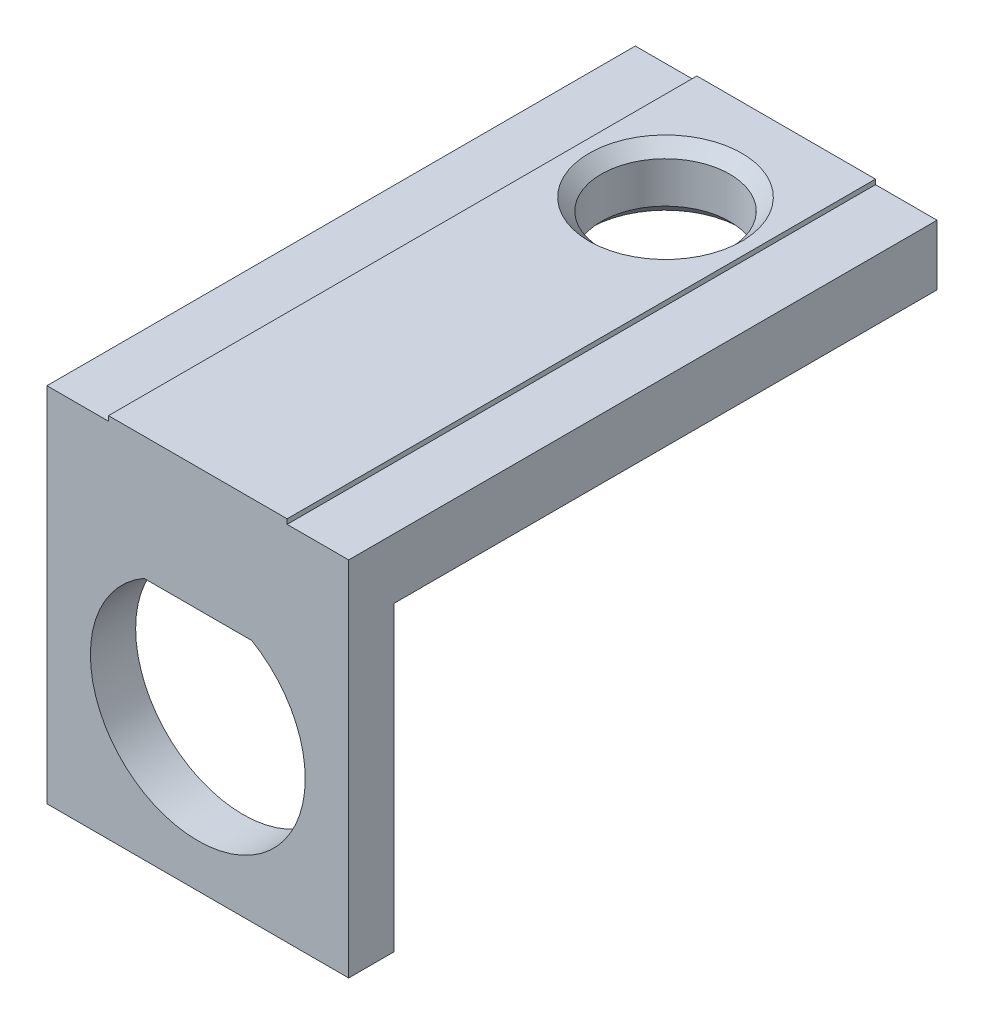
ISO-10303-21;
HEADER;
FILE_DESCRIPTION(('STEP AP214'),'2;1');
FILE_NAME('part.step','',(''),(''),'','','');
FILE_SCHEMA(('AUTOMOTIVE_DESIGN { 1 0 10303 214 1 1 1 1 }'));
ENDSEC;
DATA;
#1=APPLICATION_CONTEXT('core data for automotive mechanical design processes');
#2=APPLICATION_PROTOCOL_DEFINITION('international standard','automotive_design',2000,#1);
#3=PRODUCT_CONTEXT('',#1,'mechanical');
#4=PRODUCT('Part','Part','',(#3));
#5=PRODUCT_RELATED_PRODUCT_CATEGORY('part','',(#4));
#6=PRODUCT_DEFINITION_FORMATION('','',#4);
#7=PRODUCT_DEFINITION_CONTEXT('part definition',#1,'design');
#8=PRODUCT_DEFINITION('design','',#6,#7);
#9=PRODUCT_DEFINITION_SHAPE('','',#8);
#10=(LENGTH_UNIT() NAMED_UNIT(*) SI_UNIT(.MILLI.,.METRE.));
#11=(NAMED_UNIT(*) PLANE_ANGLE_UNIT() SI_UNIT($,.RADIAN.));
#12=(NAMED_UNIT(*) SI_UNIT($,.STERADIAN.) SOLID_ANGLE_UNIT());
#13=UNCERTAINTY_MEASURE_WITH_UNIT(LENGTH_MEASURE(1.E-05),#10,'distance_accuracy_value','');
#14=(GEOMETRIC_REPRESENTATION_CONTEXT(3) GLOBAL_UNCERTAINTY_ASSIGNED_CONTEXT((#13)) GLOBAL_UNIT_ASSIGNED_CONTEXT((#10,
#11,#12)) REPRESENTATION_CONTEXT('',''));
#15=CARTESIAN_POINT('',(0.,0.,0.));
#16=DIRECTION('',(0.,0.,1.));
#17=DIRECTION('',(1.,0.,0.));
#18=AXIS2_PLACEMENT_3D('',#15,#16,#17);
#19=CARTESIAN_POINT('',(-7.9375,11.1125,2.38125));
#20=DIRECTION('',(0.,-1.,0.));
#21=DIRECTION('',(0.,0.,-1.));
#22=AXIS2_PLACEMENT_3D('',#19,#20,#21);
#23=PLANE('',#22);
#24=DIRECTION('',(0.,0.,1.));
#25=VECTOR('',#24,1.);
#26=CARTESIAN_POINT('',(-4.699,11.1125,-28.575));
#27=LINE('',#26,#25);
#28=CARTESIAN_POINT('',(-4.699,11.1125,-28.575));
#29=VERTEX_POINT('',#28);
#30=CARTESIAN_POINT('',(-4.699,11.1125,2.38125));
#31=VERTEX_POINT('',#30);
#32=EDGE_CURVE('E151',#29,#31,#27,.T.);
#33=ORIENTED_EDGE('',*,*,#32,.F.);
#34=DIRECTION('',(1.,0.,0.));
#35=VECTOR('',#34,1.);
#36=CARTESIAN_POINT('',(7.9375,11.1125,-28.575));
#37=LINE('',#36,#35);
#38=CARTESIAN_POINT('',(-7.9375,11.1125,-28.575));
#39=VERTEX_POINT('',#38);
#40=EDGE_CURVE('E393',#39,#29,#37,.T.);
#41=ORIENTED_EDGE('',*,*,#40,.F.);
#42=DIRECTION('',(0.,0.,-1.));
#43=VECTOR('',#42,1.);
#44=CARTESIAN_POINT('',(-7.9375,11.1125,2.38125));
#45=LINE('',#44,#43);
#46=CARTESIAN_POINT('',(-7.9375,11.1125,2.38125));
#47=VERTEX_POINT('',#46);
#48=EDGE_CURVE('E45',#47,#39,#45,.T.);
#49=ORIENTED_EDGE('',*,*,#48,.F.);
#50=DIRECTION('',(-1.,0.,0.));
#51=VECTOR('',#50,1.);
#52=CARTESIAN_POINT('',(-7.9375,11.1125,2.38125));
#53=LINE('',#52,#51);
#54=EDGE_CURVE('E53',#31,#47,#53,.T.);
#55=ORIENTED_EDGE('',*,*,#54,.F.);
#56=EDGE_LOOP('',(#33,#41,#49,#55));
#57=FACE_BOUND('',#56,.T.);
#58=ADVANCED_FACE('F36',(#57),#23,.F.);
#59=DIRECTION('',(0.,0.,-1.));
#60=VECTOR('',#59,1.);
#61=CARTESIAN_POINT('',(4.699,11.1125,-28.575));
#62=LINE('',#61,#60);
#63=CARTESIAN_POINT('',(4.699,11.1125,2.38125));
#64=VERTEX_POINT('',#63);
#65=CARTESIAN_POINT('',(4.699,11.1125,-28.575));
#66=VERTEX_POINT('',#65);
#67=EDGE_CURVE('E61',#64,#66,#62,.T.);
#68=ORIENTED_EDGE('',*,*,#67,.F.);
#69=CARTESIAN_POINT('',(7.9375,11.1125,2.38125));
#70=VERTEX_POINT('',#69);
#71=EDGE_CURVE('E377',#70,#64,#53,.T.);
#72=ORIENTED_EDGE('',*,*,#71,.F.);
#73=DIRECTION('',(0.,0.,-1.));
#74=VECTOR('',#73,1.);
#75=CARTESIAN_POINT('',(7.9375,11.1125,2.38125));
#76=LINE('',#75,#74);
#77=CARTESIAN_POINT('',(7.9375,11.1125,-28.575));
#78=VERTEX_POINT('',#77);
#79=EDGE_CURVE('E11',#70,#78,#76,.T.);
#80=ORIENTED_EDGE('',*,*,#79,.T.);
#81=EDGE_CURVE('E390',#66,#78,#37,.T.);
#82=ORIENTED_EDGE('',*,*,#81,.F.);
#83=EDGE_LOOP('',(#68,#72,#80,#82));
#84=FACE_BOUND('',#83,.T.);
#85=ADVANCED_FACE('F225',(#84),#23,.F.);
#86=CARTESIAN_POINT('',(7.93750000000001,-11.1125,0.));
#87=DIRECTION('',(0.,0.,1.));
#88=DIRECTION('',(1.,0.,0.));
#89=AXIS2_PLACEMENT_3D('',#86,#87,#88);
#90=PLANE('',#89);
#91=CARTESIAN_POINT('',(0.,0.,0.));
#92=DIRECTION('',(0.,0.,1.));
#93=DIRECTION('',(1.,0.,0.));
#94=AXIS2_PLACEMENT_3D('',#91,#92,#93);
#95=CIRCLE('',#94,5.65150000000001);
#96=CARTESIAN_POINT('',(-2.83412102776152,4.8895,0.));
#97=VERTEX_POINT('',#96);
#98=CARTESIAN_POINT('',(2.83412102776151,4.8895,0.));
#99=VERTEX_POINT('',#98);
#100=EDGE_CURVE('E419',#97,#99,#95,.T.);
#101=ORIENTED_EDGE('',*,*,#100,.T.);
#102=DIRECTION('',(-1.,0.,0.));
#103=VECTOR('',#102,1.);
#104=CARTESIAN_POINT('',(-2.83412102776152,4.8895,0.));
#105=LINE('',#104,#103);
#106=EDGE_CURVE('E451',#99,#97,#105,.T.);
#107=ORIENTED_EDGE('',*,*,#106,.T.);
#108=EDGE_LOOP('',(#101,#107));
#109=FACE_BOUND('',#108,.T.);
#110=DIRECTION('',(0.,1.,0.));
#111=VECTOR('',#110,1.);
#112=CARTESIAN_POINT('',(7.9375,11.1125,0.));
#113=LINE('',#112,#111);
#114=CARTESIAN_POINT('',(7.93750000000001,-7.93750000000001,0.));
#115=VERTEX_POINT('',#114);
#116=CARTESIAN_POINT('',(7.9375,7.93749999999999,0.));
#117=VERTEX_POINT('',#116);
#118=EDGE_CURVE('E379',#115,#117,#113,.T.);
#119=ORIENTED_EDGE('',*,*,#118,.F.);
#120=DIRECTION('',(1.,0.,0.));
#121=VECTOR('',#120,1.);
#122=CARTESIAN_POINT('',(7.93750000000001,-7.93750000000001,0.));
#123=LINE('',#122,#121);
#124=CARTESIAN_POINT('',(-7.9375,-7.93750000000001,0.));
#125=VERTEX_POINT('',#124);
#126=EDGE_CURVE('E152',#125,#115,#123,.T.);
#127=ORIENTED_EDGE('',*,*,#126,.F.);
#128=DIRECTION('',(0.,-1.,0.));
#129=VECTOR('',#128,1.);
#130=CARTESIAN_POINT('',(-7.9375,11.1125,0.));
#131=LINE('',#130,#129);
#132=CARTESIAN_POINT('',(-7.9375,7.93749999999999,0.));
#133=VERTEX_POINT('',#132);
#134=EDGE_CURVE('E375',#133,#125,#131,.T.);
#135=ORIENTED_EDGE('',*,*,#134,.F.);
#136=DIRECTION('',(-1.,0.,0.));
#137=VECTOR('',#136,1.);
#138=CARTESIAN_POINT('',(7.9375,7.93749999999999,0.));
#139=LINE('',#138,#137);
#140=EDGE_CURVE('E406',#117,#133,#139,.T.);
#141=ORIENTED_EDGE('',*,*,#140,.F.);
#142=EDGE_LOOP('',(#119,#127,#135,#141));
#143=FACE_BOUND('',#142,.T.);
#144=ADVANCED_FACE('F229',(#109,#143),#90,.F.);
#145=CARTESIAN_POINT('',(7.93750000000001,-11.1125,2.38125));
#146=DIRECTION('',(0.,0.,1.));
#147=DIRECTION('',(1.,0.,0.));
#148=AXIS2_PLACEMENT_3D('',#145,#146,#147);
#149=PLANE('',#148);
#150=DIRECTION('',(1.,0.,0.));
#151=VECTOR('',#150,1.);
#152=CARTESIAN_POINT('',(7.93750000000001,-7.93750000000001,2.38125));
#153=LINE('',#152,#151);
#154=CARTESIAN_POINT('',(-7.9375,-7.93750000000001,2.38125));
#155=VERTEX_POINT('',#154);
#156=CARTESIAN_POINT('',(7.93750000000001,-7.93750000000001,2.38125));
#157=VERTEX_POINT('',#156);
#158=EDGE_CURVE('E154',#155,#157,#153,.T.);
#159=ORIENTED_EDGE('',*,*,#158,.T.);
#160=DIRECTION('',(0.,1.,0.));
#161=VECTOR('',#160,1.);
#162=CARTESIAN_POINT('',(7.9375,11.1125,2.38125));
#163=LINE('',#162,#161);
#164=EDGE_CURVE('E371',#157,#70,#163,.T.);
#165=ORIENTED_EDGE('',*,*,#164,.T.);
#166=ORIENTED_EDGE('',*,*,#71,.T.);
#167=DIRECTION('',(0.,-1.,0.));
#168=VECTOR('',#167,1.);
#169=CARTESIAN_POINT('',(4.699,11.3665,2.38125));
#170=LINE('',#169,#168);
#171=CARTESIAN_POINT('',(4.699,11.3665,2.38125));
#172=VERTEX_POINT('',#171);
#173=EDGE_CURVE('E136',#172,#64,#170,.T.);
#174=ORIENTED_EDGE('',*,*,#173,.F.);
#175=DIRECTION('',(1.,0.,0.));
#176=VECTOR('',#175,1.);
#177=CARTESIAN_POINT('',(-4.699,11.3665,2.38125));
#178=LINE('',#177,#176);
#179=CARTESIAN_POINT('',(-4.699,11.3665,2.38125));
#180=VERTEX_POINT('',#179);
#181=EDGE_CURVE('E127',#180,#172,#178,.T.);
#182=ORIENTED_EDGE('',*,*,#181,.F.);
#183=DIRECTION('',(0.,-1.,0.));
#184=VECTOR('',#183,1.);
#185=CARTESIAN_POINT('',(-4.699,11.3665,2.38125));
#186=LINE('',#185,#184);
#187=EDGE_CURVE('E133',#180,#31,#186,.T.);
#188=ORIENTED_EDGE('',*,*,#187,.T.);
#189=ORIENTED_EDGE('',*,*,#54,.T.);
#190=DIRECTION('',(0.,-1.,0.));
#191=VECTOR('',#190,1.);
#192=CARTESIAN_POINT('',(-7.9375,11.1125,2.38125));
#193=LINE('',#192,#191);
#194=EDGE_CURVE('E386',#47,#155,#193,.T.);
#195=ORIENTED_EDGE('',*,*,#194,.T.);
#196=EDGE_LOOP('',(#159,#165,#166,#174,#182,#188,#189,#195));
#197=FACE_BOUND('',#196,.T.);
#198=DIRECTION('',(-1.,0.,0.));
#199=VECTOR('',#198,1.);
#200=CARTESIAN_POINT('',(-2.83412102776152,4.8895,2.38125));
#201=LINE('',#200,#199);
#202=CARTESIAN_POINT('',(2.83412102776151,4.8895,2.38125));
#203=VERTEX_POINT('',#202);
#204=CARTESIAN_POINT('',(-2.83412102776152,4.8895,2.38125));
#205=VERTEX_POINT('',#204);
#206=EDGE_CURVE('E447',#203,#205,#201,.T.);
#207=ORIENTED_EDGE('',*,*,#206,.F.);
#208=CARTESIAN_POINT('',(0.,0.,2.38125));
#209=DIRECTION('',(0.,0.,1.));
#210=DIRECTION('',(1.,0.,0.));
#211=AXIS2_PLACEMENT_3D('',#208,#209,#210);
#212=CIRCLE('',#211,5.65150000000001);
#213=EDGE_CURVE('E403',#205,#203,#212,.T.);
#214=ORIENTED_EDGE('',*,*,#213,.F.);
#215=EDGE_LOOP('',(#207,#214));
#216=FACE_BOUND('',#215,.T.);
#217=ADVANCED_FACE('F130',(#197,#216),#149,.T.);
#218=CARTESIAN_POINT('',(7.9375,11.1125,2.38125));
#219=DIRECTION('',(-1.,0.,0.));
#220=DIRECTION('',(0.,-1.,0.));
#221=AXIS2_PLACEMENT_3D('',#218,#219,#220);
#222=PLANE('',#221);
#223=ORIENTED_EDGE('',*,*,#164,.F.);
#224=DIRECTION('',(0.,0.,-1.));
#225=VECTOR('',#224,1.);
#226=CARTESIAN_POINT('',(7.93750000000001,-7.93750000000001,2.38125));
#227=LINE('',#226,#225);
#228=EDGE_CURVE('E372',#157,#115,#227,.T.);
#229=ORIENTED_EDGE('',*,*,#228,.T.);
#230=ORIENTED_EDGE('',*,*,#118,.T.);
#231=DIRECTION('',(0.,0.,1.));
#232=VECTOR('',#231,1.);
#233=CARTESIAN_POINT('',(7.9375,7.93749999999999,-28.575));
#234=LINE('',#233,#232);
#235=CARTESIAN_POINT('',(7.9375,7.93749999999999,-28.575));
#236=VERTEX_POINT('',#235);
#237=EDGE_CURVE('E414',#236,#117,#234,.T.);
#238=ORIENTED_EDGE('',*,*,#237,.F.);
#239=DIRECTION('',(0.,-1.,0.));
#240=VECTOR('',#239,1.);
#241=CARTESIAN_POINT('',(7.9375,11.1125,-28.575));
#242=LINE('',#241,#240);
#243=EDGE_CURVE('E409',#78,#236,#242,.T.);
#244=ORIENTED_EDGE('',*,*,#243,.F.);
#245=ORIENTED_EDGE('',*,*,#79,.F.);
#246=EDGE_LOOP('',(#223,#229,#230,#238,#244,#245));
#247=FACE_BOUND('',#246,.T.);
#248=ADVANCED_FACE('F38',(#247),#222,.F.);
#249=CARTESIAN_POINT('',(-7.9375,11.1125,2.38125));
#250=DIRECTION('',(1.,0.,0.));
#251=DIRECTION('',(0.,1.,0.));
#252=AXIS2_PLACEMENT_3D('',#249,#250,#251);
#253=PLANE('',#252);
#254=ORIENTED_EDGE('',*,*,#134,.T.);
#255=DIRECTION('',(0.,0.,-1.));
#256=VECTOR('',#255,1.);
#257=CARTESIAN_POINT('',(-7.9375,-7.93750000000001,2.38125));
#258=LINE('',#257,#256);
#259=EDGE_CURVE('E429',#155,#125,#258,.T.);
#260=ORIENTED_EDGE('',*,*,#259,.F.);
#261=ORIENTED_EDGE('',*,*,#194,.F.);
#262=ORIENTED_EDGE('',*,*,#48,.T.);
#263=DIRECTION('',(0.,1.,0.));
#264=VECTOR('',#263,1.);
#265=CARTESIAN_POINT('',(-7.9375,11.1125,-28.575));
#266=LINE('',#265,#264);
#267=CARTESIAN_POINT('',(-7.9375,7.93749999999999,-28.575));
#268=VERTEX_POINT('',#267);
#269=EDGE_CURVE('E394',#268,#39,#266,.T.);
#270=ORIENTED_EDGE('',*,*,#269,.F.);
#271=DIRECTION('',(0.,0.,1.));
#272=VECTOR('',#271,1.);
#273=CARTESIAN_POINT('',(-7.9375,7.93749999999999,-28.575));
#274=LINE('',#273,#272);
#275=EDGE_CURVE('E411',#268,#133,#274,.T.);
#276=ORIENTED_EDGE('',*,*,#275,.T.);
#277=EDGE_LOOP('',(#254,#260,#261,#262,#270,#276));
#278=FACE_BOUND('',#277,.T.);
#279=ADVANCED_FACE('F231',(#278),#253,.F.);
#280=CARTESIAN_POINT('',(0.,0.,2.38125));
#281=DIRECTION('',(0.,0.,-1.));
#282=DIRECTION('',(-1.,0.,0.));
#283=AXIS2_PLACEMENT_3D('',#280,#281,#282);
#284=CYLINDRICAL_SURFACE('',#283,5.65150000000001);
#285=ORIENTED_EDGE('',*,*,#100,.F.);
#286=DIRECTION('',(0.,0.,-1.));
#287=VECTOR('',#286,1.);
#288=CARTESIAN_POINT('',(-2.83412102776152,4.8895,2.38125));
#289=LINE('',#288,#287);
#290=EDGE_CURVE('E443',#205,#97,#289,.T.);
#291=ORIENTED_EDGE('',*,*,#290,.F.);
#292=ORIENTED_EDGE('',*,*,#213,.T.);
#293=DIRECTION('',(0.,0.,-1.));
#294=VECTOR('',#293,1.);
#295=CARTESIAN_POINT('',(2.83412102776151,4.8895,2.38125));
#296=LINE('',#295,#294);
#297=EDGE_CURVE('E382',#203,#99,#296,.T.);
#298=ORIENTED_EDGE('',*,*,#297,.T.);
#299=EDGE_LOOP('',(#285,#291,#292,#298));
#300=FACE_BOUND('',#299,.T.);
#301=ADVANCED_FACE('F234',(#300),#284,.F.);
#302=CARTESIAN_POINT('',(-2.83412102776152,4.8895,2.38125));
#303=DIRECTION('',(0.,-1.,0.));
#304=DIRECTION('',(0.,0.,-1.));
#305=AXIS2_PLACEMENT_3D('',#302,#303,#304);
#306=PLANE('',#305);
#307=ORIENTED_EDGE('',*,*,#106,.F.);
#308=ORIENTED_EDGE('',*,*,#297,.F.);
#309=ORIENTED_EDGE('',*,*,#206,.T.);
#310=ORIENTED_EDGE('',*,*,#290,.T.);
#311=EDGE_LOOP('',(#307,#308,#309,#310));
#312=FACE_BOUND('',#311,.T.);
#313=ADVANCED_FACE('F243',(#312),#306,.T.);
#314=CARTESIAN_POINT('',(7.9375,7.93749999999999,-28.575));
#315=DIRECTION('',(0.,1.,0.));
#316=DIRECTION('',(0.,0.,1.));
#317=AXIS2_PLACEMENT_3D('',#314,#315,#316);
#318=PLANE('',#317);
#319=CARTESIAN_POINT('',(0.,7.93749999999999,-22.225));
#320=DIRECTION('',(0.,1.,0.));
#321=DIRECTION('',(0.,0.,1.));
#322=AXIS2_PLACEMENT_3D('',#319,#320,#321);
#323=CIRCLE('',#322,4.0132);
#324=CARTESIAN_POINT('',(0.,7.93749999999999,-18.2118));
#325=VERTEX_POINT('',#324);
#326=EDGE_CURVE('E191',#325,#325,#323,.T.);
#327=ORIENTED_EDGE('',*,*,#326,.T.);
#328=EDGE_LOOP('',(#327));
#329=FACE_BOUND('',#328,.T.);
#330=ORIENTED_EDGE('',*,*,#140,.T.);
#331=ORIENTED_EDGE('',*,*,#275,.F.);
#332=DIRECTION('',(-1.,0.,0.));
#333=VECTOR('',#332,1.);
#334=CARTESIAN_POINT('',(7.9375,7.93749999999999,-28.575));
#335=LINE('',#334,#333);
#336=EDGE_CURVE('E435',#236,#268,#335,.T.);
#337=ORIENTED_EDGE('',*,*,#336,.F.);
#338=ORIENTED_EDGE('',*,*,#237,.T.);
#339=EDGE_LOOP('',(#330,#331,#337,#338));
#340=FACE_BOUND('',#339,.T.);
#341=ADVANCED_FACE('F195',(#329,#340),#318,.F.);
#342=CARTESIAN_POINT('',(7.9375,7.93749999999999,-28.575));
#343=DIRECTION('',(0.,0.,-1.));
#344=DIRECTION('',(-1.,0.,0.));
#345=AXIS2_PLACEMENT_3D('',#342,#343,#344);
#346=PLANE('',#345);
#347=ORIENTED_EDGE('',*,*,#243,.T.);
#348=ORIENTED_EDGE('',*,*,#336,.T.);
#349=ORIENTED_EDGE('',*,*,#269,.T.);
#350=ORIENTED_EDGE('',*,*,#40,.T.);
#351=DIRECTION('',(0.,-1.,0.));
#352=VECTOR('',#351,1.);
#353=CARTESIAN_POINT('',(-4.699,11.3665,-28.575));
#354=LINE('',#353,#352);
#355=CARTESIAN_POINT('',(-4.699,11.3665,-28.575));
#356=VERTEX_POINT('',#355);
#357=EDGE_CURVE('E165',#356,#29,#354,.T.);
#358=ORIENTED_EDGE('',*,*,#357,.F.);
#359=DIRECTION('',(-1.,0.,0.));
#360=VECTOR('',#359,1.);
#361=CARTESIAN_POINT('',(-4.699,11.3665,-28.575));
#362=LINE('',#361,#360);
#363=CARTESIAN_POINT('',(4.699,11.3665,-28.575));
#364=VERTEX_POINT('',#363);
#365=EDGE_CURVE('E145',#364,#356,#362,.T.);
#366=ORIENTED_EDGE('',*,*,#365,.F.);
#367=DIRECTION('',(0.,-1.,0.));
#368=VECTOR('',#367,1.);
#369=CARTESIAN_POINT('',(4.699,11.3665,-28.575));
#370=LINE('',#369,#368);
#371=EDGE_CURVE('E156',#364,#66,#370,.T.);
#372=ORIENTED_EDGE('',*,*,#371,.T.);
#373=ORIENTED_EDGE('',*,*,#81,.T.);
#374=EDGE_LOOP('',(#347,#348,#349,#350,#358,#366,#372,#373));
#375=FACE_BOUND('',#374,.T.);
#376=ADVANCED_FACE('F250',(#375),#346,.T.);
#377=CARTESIAN_POINT('',(7.93750000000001,-7.93750000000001,2.38125));
#378=DIRECTION('',(0.,1.,0.));
#379=DIRECTION('',(0.,0.,1.));
#380=AXIS2_PLACEMENT_3D('',#377,#378,#379);
#381=PLANE('',#380);
#382=ORIENTED_EDGE('',*,*,#126,.T.);
#383=ORIENTED_EDGE('',*,*,#228,.F.);
#384=ORIENTED_EDGE('',*,*,#158,.F.);
#385=ORIENTED_EDGE('',*,*,#259,.T.);
#386=EDGE_LOOP('',(#382,#383,#384,#385));
#387=FACE_BOUND('',#386,.T.);
#388=ADVANCED_FACE('F253',(#387),#381,.F.);
#389=CARTESIAN_POINT('',(-4.699,11.3665,-28.575));
#390=DIRECTION('',(1.,0.,0.));
#391=DIRECTION('',(0.,0.,-1.));
#392=AXIS2_PLACEMENT_3D('',#389,#390,#391);
#393=PLANE('',#392);
#394=ORIENTED_EDGE('',*,*,#32,.T.);
#395=ORIENTED_EDGE('',*,*,#187,.F.);
#396=DIRECTION('',(0.,0.,1.));
#397=VECTOR('',#396,1.);
#398=CARTESIAN_POINT('',(-4.699,11.3665,-28.575));
#399=LINE('',#398,#397);
#400=EDGE_CURVE('E140',#356,#180,#399,.T.);
#401=ORIENTED_EDGE('',*,*,#400,.F.);
#402=ORIENTED_EDGE('',*,*,#357,.T.);
#403=EDGE_LOOP('',(#394,#395,#401,#402));
#404=FACE_BOUND('',#403,.T.);
#405=ADVANCED_FACE('F150',(#404),#393,.F.);
#406=CARTESIAN_POINT('',(4.699,11.3665,-28.575));
#407=DIRECTION('',(-1.,0.,0.));
#408=DIRECTION('',(0.,0.,1.));
#409=AXIS2_PLACEMENT_3D('',#406,#407,#408);
#410=PLANE('',#409);
#411=ORIENTED_EDGE('',*,*,#67,.T.);
#412=ORIENTED_EDGE('',*,*,#371,.F.);
#413=DIRECTION('',(0.,0.,-1.));
#414=VECTOR('',#413,1.);
#415=CARTESIAN_POINT('',(4.699,11.3665,-28.575));
#416=LINE('',#415,#414);
#417=EDGE_CURVE('E139',#172,#364,#416,.T.);
#418=ORIENTED_EDGE('',*,*,#417,.F.);
#419=ORIENTED_EDGE('',*,*,#173,.T.);
#420=EDGE_LOOP('',(#411,#412,#418,#419));
#421=FACE_BOUND('',#420,.T.);
#422=ADVANCED_FACE('F217',(#421),#410,.F.);
#423=CARTESIAN_POINT('',(-4.699,11.3665,2.38125));
#424=DIRECTION('',(0.,1.,0.));
#425=DIRECTION('',(0.,0.,1.));
#426=AXIS2_PLACEMENT_3D('',#423,#424,#425);
#427=PLANE('',#426);
#428=CARTESIAN_POINT('',(0.,11.3665,-22.225));
#429=DIRECTION('',(0.,1.,0.));
#430=DIRECTION('',(0.,0.,1.));
#431=AXIS2_PLACEMENT_3D('',#428,#429,#430);
#432=CIRCLE('',#431,4.0132);
#433=CARTESIAN_POINT('',(0.,11.3665,-18.2118));
#434=VERTEX_POINT('',#433);
#435=EDGE_CURVE('E188',#434,#434,#432,.T.);
#436=ORIENTED_EDGE('',*,*,#435,.F.);
#437=EDGE_LOOP('',(#436));
#438=FACE_BOUND('',#437,.T.);
#439=ORIENTED_EDGE('',*,*,#400,.T.);
#440=ORIENTED_EDGE('',*,*,#181,.T.);
#441=ORIENTED_EDGE('',*,*,#417,.T.);
#442=ORIENTED_EDGE('',*,*,#365,.T.);
#443=EDGE_LOOP('',(#439,#440,#441,#442));
#444=FACE_BOUND('',#443,.T.);
#445=ADVANCED_FACE('F143',(#438,#444),#427,.T.);
#446=CARTESIAN_POINT('',(0.,8.57249999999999,-22.225));
#447=DIRECTION('',(0.,-1.,0.));
#448=DIRECTION('',(0.,0.,-1.));
#449=AXIS2_PLACEMENT_3D('',#446,#447,#448);
#450=CONICAL_SURFACE('',#449,3.3782,0.78539816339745);
#451=ORIENTED_EDGE('',*,*,#326,.F.);
#452=EDGE_LOOP('',(#451));
#453=FACE_BOUND('',#452,.T.);
#454=CARTESIAN_POINT('',(0.,8.57249999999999,-22.225));
#455=DIRECTION('',(0.,1.,0.));
#456=DIRECTION('',(0.,0.,1.));
#457=AXIS2_PLACEMENT_3D('',#454,#455,#456);
#458=CIRCLE('',#457,3.3782);
#459=CARTESIAN_POINT('',(0.,8.57249999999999,-18.8468));
#460=VERTEX_POINT('',#459);
#461=EDGE_CURVE('E164',#460,#460,#458,.T.);
#462=ORIENTED_EDGE('',*,*,#461,.T.);
#463=EDGE_LOOP('',(#462));
#464=FACE_BOUND('',#463,.T.);
#465=ADVANCED_FACE('F198',(#453,#464),#450,.F.);
#466=CARTESIAN_POINT('',(0.,11.3665,-22.225));
#467=DIRECTION('',(0.,1.,0.));
#468=DIRECTION('',(0.,0.,1.));
#469=AXIS2_PLACEMENT_3D('',#466,#467,#468);
#470=CYLINDRICAL_SURFACE('',#469,3.3782);
#471=ORIENTED_EDGE('',*,*,#461,.F.);
#472=EDGE_LOOP('',(#471));
#473=FACE_BOUND('',#472,.T.);
#474=CARTESIAN_POINT('',(0.,10.7315,-22.225));
#475=DIRECTION('',(0.,1.,0.));
#476=DIRECTION('',(0.,0.,1.));
#477=AXIS2_PLACEMENT_3D('',#474,#475,#476);
#478=CIRCLE('',#477,3.3782);
#479=CARTESIAN_POINT('',(0.,10.7315,-18.8468));
#480=VERTEX_POINT('',#479);
#481=EDGE_CURVE('E185',#480,#480,#478,.T.);
#482=ORIENTED_EDGE('',*,*,#481,.T.);
#483=EDGE_LOOP('',(#482));
#484=FACE_BOUND('',#483,.T.);
#485=ADVANCED_FACE('F201',(#473,#484),#470,.F.);
#486=CARTESIAN_POINT('',(0.,11.3665,-22.225));
#487=DIRECTION('',(0.,1.,0.));
#488=DIRECTION('',(0.,0.,1.));
#489=AXIS2_PLACEMENT_3D('',#486,#487,#488);
#490=CONICAL_SURFACE('',#489,4.0132,0.785398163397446);
#491=ORIENTED_EDGE('',*,*,#481,.F.);
#492=EDGE_LOOP('',(#491));
#493=FACE_BOUND('',#492,.T.);
#494=ORIENTED_EDGE('',*,*,#435,.T.);
#495=EDGE_LOOP('',(#494));
#496=FACE_BOUND('',#495,.T.);
#497=ADVANCED_FACE('F207',(#493,#496),#490,.F.);
#498=CLOSED_SHELL('',(#58,#85,#144,#217,#248,#279,#301,#313,#341,#376,#388,#405,#422,#445,#465,
#485,#497));
#499=MANIFOLD_SOLID_BREP('B2',#498);
#500=ADVANCED_BREP_SHAPE_REPRESENTATION('',(#18,#499),#14);
#501=SHAPE_DEFINITION_REPRESENTATION(#9,#500);
ENDSEC;
END-ISO-10303-21;
